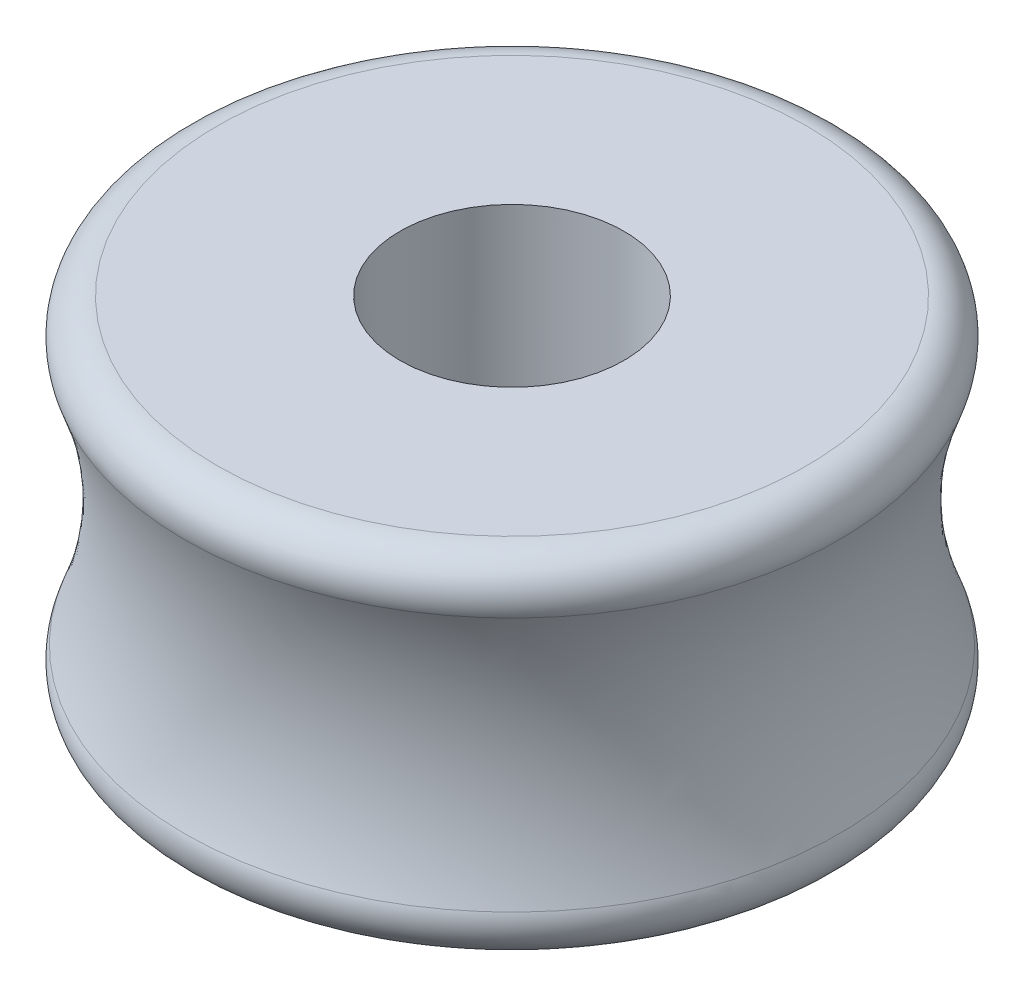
ISO-10303-21;
HEADER;
FILE_DESCRIPTION(('STEP AP214'),'2;1');
FILE_NAME('part.step','',(''),(''),'','','');
FILE_SCHEMA(('AUTOMOTIVE_DESIGN { 1 0 10303 214 1 1 1 1 }'));
ENDSEC;
DATA;
#1=APPLICATION_CONTEXT('core data for automotive mechanical design processes');
#2=APPLICATION_PROTOCOL_DEFINITION('international standard','automotive_design',2000,#1);
#3=PRODUCT_CONTEXT('',#1,'mechanical');
#4=PRODUCT('Part','Part','',(#3));
#5=PRODUCT_RELATED_PRODUCT_CATEGORY('part','',(#4));
#6=PRODUCT_DEFINITION_FORMATION('','',#4);
#7=PRODUCT_DEFINITION_CONTEXT('part definition',#1,'design');
#8=PRODUCT_DEFINITION('design','',#6,#7);
#9=PRODUCT_DEFINITION_SHAPE('','',#8);
#10=(LENGTH_UNIT() NAMED_UNIT(*) SI_UNIT(.MILLI.,.METRE.));
#11=(NAMED_UNIT(*) PLANE_ANGLE_UNIT() SI_UNIT($,.RADIAN.));
#12=(NAMED_UNIT(*) SI_UNIT($,.STERADIAN.) SOLID_ANGLE_UNIT());
#13=UNCERTAINTY_MEASURE_WITH_UNIT(LENGTH_MEASURE(1.E-05),#10,'distance_accuracy_value','');
#14=(GEOMETRIC_REPRESENTATION_CONTEXT(3) GLOBAL_UNCERTAINTY_ASSIGNED_CONTEXT((#13)) GLOBAL_UNIT_ASSIGNED_CONTEXT((#10,
#11,#12)) REPRESENTATION_CONTEXT('',''));
#15=CARTESIAN_POINT('',(0.,0.,0.));
#16=DIRECTION('',(0.,0.,1.));
#17=DIRECTION('',(1.,0.,0.));
#18=AXIS2_PLACEMENT_3D('',#15,#16,#17);
#19=CARTESIAN_POINT('',(0.,0.,0.));
#20=DIRECTION('',(0.,1.,0.));
#21=DIRECTION('',(0.,0.,1.));
#22=AXIS2_PLACEMENT_3D('',#19,#20,#21);
#23=CYLINDRICAL_SURFACE('',#22,1.6);
#24=CARTESIAN_POINT('',(0.,-4.84,0.));
#25=DIRECTION('',(0.,-1.,0.));
#26=DIRECTION('',(0.,0.,-1.));
#27=AXIS2_PLACEMENT_3D('',#24,#25,#26);
#28=CIRCLE('',#27,1.6);
#29=CARTESIAN_POINT('',(0.,-4.84,-1.6));
#30=VERTEX_POINT('',#29);
#31=EDGE_CURVE('E10',#30,#30,#28,.T.);
#32=ORIENTED_EDGE('',*,*,#31,.T.);
#33=EDGE_LOOP('',(#32));
#34=FACE_BOUND('',#33,.T.);
#35=CARTESIAN_POINT('',(0.,0.,0.));
#36=DIRECTION('',(0.,1.,0.));
#37=DIRECTION('',(0.,0.,1.));
#38=AXIS2_PLACEMENT_3D('',#35,#36,#37);
#39=CIRCLE('',#38,1.6);
#40=CARTESIAN_POINT('',(0.,0.,1.6));
#41=VERTEX_POINT('',#40);
#42=EDGE_CURVE('E57',#41,#41,#39,.T.);
#43=ORIENTED_EDGE('',*,*,#42,.T.);
#44=EDGE_LOOP('',(#43));
#45=FACE_BOUND('',#44,.T.);
#46=ADVANCED_FACE('F43',(#34,#45),#23,.F.);
#47=CARTESIAN_POINT('',(-4.2066516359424,0.,0.));
#48=DIRECTION('',(0.,1.,0.));
#49=DIRECTION('',(0.,0.,1.));
#50=AXIS2_PLACEMENT_3D('',#47,#48,#49);
#51=PLANE('',#50);
#52=CARTESIAN_POINT('',(0.,0.,0.));
#53=DIRECTION('',(0.,1.,0.));
#54=DIRECTION('',(0.,0.,1.));
#55=AXIS2_PLACEMENT_3D('',#52,#53,#54);
#56=CIRCLE('',#55,4.2066516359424);
#57=CARTESIAN_POINT('',(0.,0.,4.2066516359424));
#58=VERTEX_POINT('',#57);
#59=EDGE_CURVE('E62',#58,#58,#56,.T.);
#60=ORIENTED_EDGE('',*,*,#59,.T.);
#61=EDGE_LOOP('',(#60));
#62=FACE_BOUND('',#61,.T.);
#63=ORIENTED_EDGE('',*,*,#42,.F.);
#64=EDGE_LOOP('',(#63));
#65=FACE_BOUND('',#64,.T.);
#66=ADVANCED_FACE('F95',(#62,#65),#51,.T.);
#67=CARTESIAN_POINT('',(0.,-0.5,0.));
#68=DIRECTION('',(0.,1.,0.));
#69=DIRECTION('',(0.,0.,1.));
#70=AXIS2_PLACEMENT_3D('',#67,#68,#69);
#71=TOROIDAL_SURFACE('',#70,4.2066516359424,0.500000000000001);
#72=CARTESIAN_POINT('',(0.,-0.681818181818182,0.));
#73=DIRECTION('',(0.,1.,0.));
#74=DIRECTION('',(0.,0.,1.));
#75=AXIS2_PLACEMENT_3D('',#72,#73,#74);
#76=CIRCLE('',#75,4.6724221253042);
#77=CARTESIAN_POINT('',(0.,-0.681818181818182,4.6724221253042));
#78=VERTEX_POINT('',#77);
#79=EDGE_CURVE('E68',#78,#78,#76,.T.);
#80=ORIENTED_EDGE('',*,*,#79,.T.);
#81=EDGE_LOOP('',(#80));
#82=FACE_BOUND('',#81,.T.);
#83=ORIENTED_EDGE('',*,*,#59,.F.);
#84=EDGE_LOOP('',(#83));
#85=FACE_BOUND('',#84,.T.);
#86=ADVANCED_FACE('F99',(#82,#85),#71,.T.);
#87=CARTESIAN_POINT('',(0.,-2.5,0.));
#88=DIRECTION('',(0.,1.,0.));
#89=DIRECTION('',(0.,0.,1.));
#90=AXIS2_PLACEMENT_3D('',#87,#88,#89);
#91=TOROIDAL_SURFACE('',#90,9.33012701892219,5.);
#92=CARTESIAN_POINT('',(0.,-4.31818181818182,0.));
#93=DIRECTION('',(0.,1.,0.));
#94=DIRECTION('',(0.,0.,1.));
#95=AXIS2_PLACEMENT_3D('',#92,#93,#94);
#96=CIRCLE('',#95,4.6724221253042);
#97=CARTESIAN_POINT('',(0.,-4.31818181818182,4.6724221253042));
#98=VERTEX_POINT('',#97);
#99=EDGE_CURVE('E72',#98,#98,#96,.T.);
#100=ORIENTED_EDGE('',*,*,#99,.T.);
#101=EDGE_LOOP('',(#100));
#102=FACE_BOUND('',#101,.T.);
#103=ORIENTED_EDGE('',*,*,#79,.F.);
#104=EDGE_LOOP('',(#103));
#105=FACE_BOUND('',#104,.T.);
#106=ADVANCED_FACE('F92',(#102,#105),#91,.F.);
#107=CARTESIAN_POINT('',(0.,-4.5,0.));
#108=DIRECTION('',(0.,1.,0.));
#109=DIRECTION('',(0.,0.,1.));
#110=AXIS2_PLACEMENT_3D('',#107,#108,#109);
#111=TOROIDAL_SURFACE('',#110,4.2066516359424,0.5);
#112=CARTESIAN_POINT('',(0.,-5.,0.));
#113=DIRECTION('',(0.,1.,0.));
#114=DIRECTION('',(0.,0.,1.));
#115=AXIS2_PLACEMENT_3D('',#112,#113,#114);
#116=CIRCLE('',#115,4.2066516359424);
#117=CARTESIAN_POINT('',(0.,-5.,4.2066516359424));
#118=VERTEX_POINT('',#117);
#119=EDGE_CURVE('E76',#118,#118,#116,.T.);
#120=ORIENTED_EDGE('',*,*,#119,.T.);
#121=EDGE_LOOP('',(#120));
#122=FACE_BOUND('',#121,.T.);
#123=ORIENTED_EDGE('',*,*,#99,.F.);
#124=EDGE_LOOP('',(#123));
#125=FACE_BOUND('',#124,.T.);
#126=ADVANCED_FACE('F81',(#122,#125),#111,.T.);
#127=CARTESIAN_POINT('',(-1.6,-5.,0.));
#128=DIRECTION('',(0.,-1.,0.));
#129=DIRECTION('',(0.,0.,-1.));
#130=AXIS2_PLACEMENT_3D('',#127,#128,#129);
#131=PLANE('',#130);
#132=CARTESIAN_POINT('',(0.,-5.,0.));
#133=DIRECTION('',(0.,-1.,0.));
#134=DIRECTION('',(0.,0.,-1.));
#135=AXIS2_PLACEMENT_3D('',#132,#133,#134);
#136=CIRCLE('',#135,1.76);
#137=CARTESIAN_POINT('',(0.,-5.,-1.76));
#138=VERTEX_POINT('',#137);
#139=EDGE_CURVE('E52',#138,#138,#136,.F.);
#140=ORIENTED_EDGE('',*,*,#139,.T.);
#141=EDGE_LOOP('',(#140));
#142=FACE_BOUND('',#141,.T.);
#143=ORIENTED_EDGE('',*,*,#119,.F.);
#144=EDGE_LOOP('',(#143));
#145=FACE_BOUND('',#144,.T.);
#146=ADVANCED_FACE('F84',(#142,#145),#131,.T.);
#147=CARTESIAN_POINT('',(0.,-5.,0.));
#148=DIRECTION('',(0.,-1.,0.));
#149=DIRECTION('',(0.,0.,-1.));
#150=AXIS2_PLACEMENT_3D('',#147,#148,#149);
#151=CONICAL_SURFACE('',#150,1.76,0.785398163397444);
#152=ORIENTED_EDGE('',*,*,#31,.F.);
#153=EDGE_LOOP('',(#152));
#154=FACE_BOUND('',#153,.T.);
#155=ORIENTED_EDGE('',*,*,#139,.F.);
#156=EDGE_LOOP('',(#155));
#157=FACE_BOUND('',#156,.T.);
#158=ADVANCED_FACE('F46',(#154,#157),#151,.F.);
#159=CLOSED_SHELL('',(#46,#66,#86,#106,#126,#146,#158));
#160=MANIFOLD_SOLID_BREP('B2',#159);
#161=ADVANCED_BREP_SHAPE_REPRESENTATION('',(#18,#160),#14);
#162=SHAPE_DEFINITION_REPRESENTATION(#9,#161);
ENDSEC;
END-ISO-10303-21;
